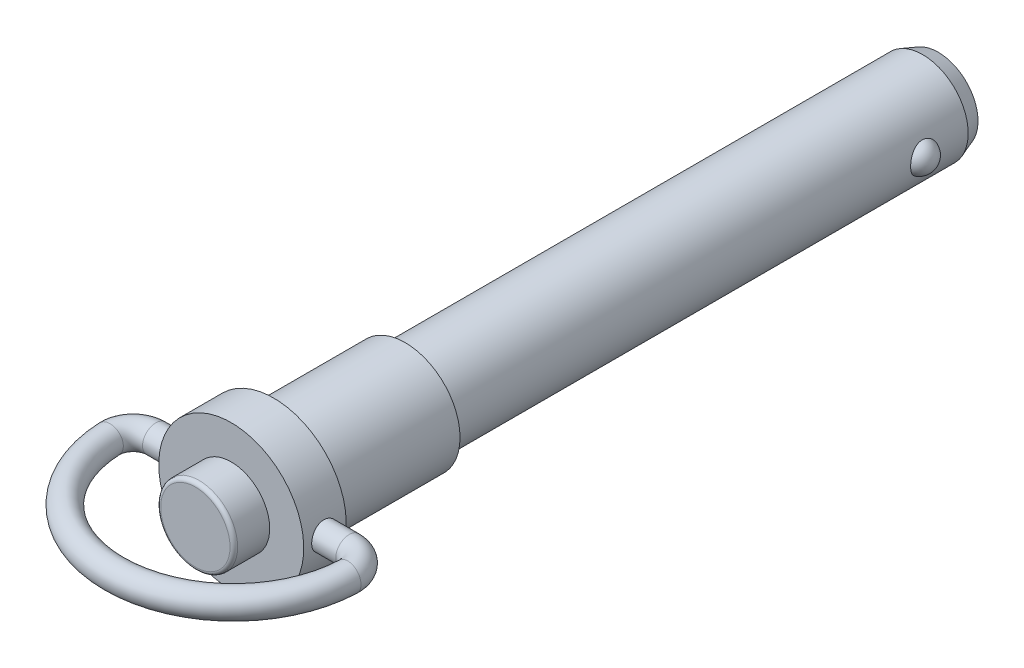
ISO-10303-21;
HEADER;
FILE_DESCRIPTION(('STEP AP214'),'2;1');
FILE_NAME('part.step','',(''),(''),'','','');
FILE_SCHEMA(('AUTOMOTIVE_DESIGN { 1 0 10303 214 1 1 1 1 }'));
ENDSEC;
DATA;
#1=APPLICATION_CONTEXT('core data for automotive mechanical design processes');
#2=APPLICATION_PROTOCOL_DEFINITION('international standard','automotive_design',2000,#1);
#3=PRODUCT_CONTEXT('',#1,'mechanical');
#4=PRODUCT('Part','Part','',(#3));
#5=PRODUCT_RELATED_PRODUCT_CATEGORY('part','',(#4));
#6=PRODUCT_DEFINITION_FORMATION('','',#4);
#7=PRODUCT_DEFINITION_CONTEXT('part definition',#1,'design');
#8=PRODUCT_DEFINITION('design','',#6,#7);
#9=PRODUCT_DEFINITION_SHAPE('','',#8);
#10=(LENGTH_UNIT() NAMED_UNIT(*) SI_UNIT(.MILLI.,.METRE.));
#11=(NAMED_UNIT(*) PLANE_ANGLE_UNIT() SI_UNIT($,.RADIAN.));
#12=(NAMED_UNIT(*) SI_UNIT($,.STERADIAN.) SOLID_ANGLE_UNIT());
#13=UNCERTAINTY_MEASURE_WITH_UNIT(LENGTH_MEASURE(1.E-05),#10,'distance_accuracy_value','');
#14=(GEOMETRIC_REPRESENTATION_CONTEXT(3) GLOBAL_UNCERTAINTY_ASSIGNED_CONTEXT((#13)) GLOBAL_UNIT_ASSIGNED_CONTEXT((#10,
#11,#12)) REPRESENTATION_CONTEXT('',''));
#15=CARTESIAN_POINT('',(0.,0.,0.));
#16=DIRECTION('',(0.,0.,1.));
#17=DIRECTION('',(1.,0.,0.));
#18=AXIS2_PLACEMENT_3D('',#15,#16,#17);
#19=CARTESIAN_POINT('',(-5.23004748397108,0.,-70.0304));
#20=DIRECTION('',(0.,0.,1.));
#21=DIRECTION('',(0.,1.,0.));
#22=AXIS2_PLACEMENT_3D('',#19,#20,#21);
#23=PLANE('',#22);
#24=CARTESIAN_POINT('',(0.,0.,-70.0303999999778));
#25=DIRECTION('',(0.,0.,1.));
#26=DIRECTION('',(0.,1.,0.));
#27=AXIS2_PLACEMENT_3D('',#24,#25,#26);
#28=CIRCLE('',#27,5.23004748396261);
#29=CARTESIAN_POINT('',(0.,5.23004748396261,-70.0303999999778));
#30=VERTEX_POINT('',#29);
#31=EDGE_CURVE('E117',#30,#30,#28,.T.);
#32=ORIENTED_EDGE('',*,*,#31,.F.);
#33=EDGE_LOOP('',(#32));
#34=FACE_BOUND('',#33,.T.);
#35=ADVANCED_FACE('F12',(#34),#23,.F.);
#36=CARTESIAN_POINT('',(-5.24129,0.,-62.2834));
#37=DIRECTION('',(0.,0.,1.));
#38=DIRECTION('',(-1.,0.,0.));
#39=AXIS2_PLACEMENT_3D('',#36,#37,#38);
#40=SPHERICAL_SURFACE('',#39,1.98374);
#41=CARTESIAN_POINT('',(-5.969635,0.,-60.4382067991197));
#42=CARTESIAN_POINT('',(-5.96963006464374,-0.11101568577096,-60.4382116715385));
#43=CARTESIAN_POINT('',(-5.96650644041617,-0.222143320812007,-60.4470278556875));
#44=CARTESIAN_POINT('',(-5.95431160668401,-0.441381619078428,-60.4821762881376));
#45=CARTESIAN_POINT('',(-5.9452309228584,-0.549487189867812,-60.5085364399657));
#46=CARTESIAN_POINT('',(-5.92206953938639,-0.759461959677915,-60.5783068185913));
#47=CARTESIAN_POINT('',(-5.90799052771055,-0.861333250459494,-60.6217112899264));
#48=CARTESIAN_POINT('',(-5.87633956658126,-1.05588670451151,-60.7247452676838));
#49=CARTESIAN_POINT('',(-5.85876868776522,-1.14857167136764,-60.7843698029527));
#50=CARTESIAN_POINT('',(-5.82223010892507,-1.32133430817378,-60.9181231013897));
#51=CARTESIAN_POINT('',(-5.80327429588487,-1.40150415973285,-60.9921358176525));
#52=CARTESIAN_POINT('',(-5.76604946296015,-1.54754922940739,-61.1533071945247));
#53=CARTESIAN_POINT('',(-5.74778035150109,-1.61342635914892,-61.2404640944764));
#54=CARTESIAN_POINT('',(-5.71483308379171,-1.72643370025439,-61.4221868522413));
#55=CARTESIAN_POINT('',(-5.70004608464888,-1.77417349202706,-61.5163531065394));
#56=CARTESIAN_POINT('',(-5.67505831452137,-1.8525561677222,-61.7121159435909));
#57=CARTESIAN_POINT('',(-5.66485545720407,-1.88320683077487,-61.8137091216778));
#58=CARTESIAN_POINT('',(-5.65080765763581,-1.92493419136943,-62.0148687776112));
#59=CARTESIAN_POINT('',(-5.64661793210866,-1.93707510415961,-62.1141910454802));
#60=CARTESIAN_POINT('',(-5.64397531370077,-1.94476367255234,-62.3135411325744));
#61=CARTESIAN_POINT('',(-5.64552102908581,-1.94031535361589,-62.4135687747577));
#62=CARTESIAN_POINT('',(-5.65399944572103,-1.9154603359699,-62.6076677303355));
#63=CARTESIAN_POINT('',(-5.66073469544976,-1.89563839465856,-62.7018234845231));
#64=CARTESIAN_POINT('',(-5.67860059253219,-1.84142507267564,-62.8853806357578));
#65=CARTESIAN_POINT('',(-5.68973152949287,-1.80703273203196,-62.9747817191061));
#66=CARTESIAN_POINT('',(-5.71546454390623,-1.72392617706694,-63.1482988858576));
#67=CARTESIAN_POINT('',(-5.730129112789,-1.67494987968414,-63.2322806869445));
#68=CARTESIAN_POINT('',(-5.75347973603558,-1.59211635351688,-63.3513225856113));
#69=CARTESIAN_POINT('',(-5.7614912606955,-1.56293448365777,-63.38985758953));
#70=CARTESIAN_POINT('',(-5.7777780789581,-1.50160973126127,-63.464489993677));
#71=CARTESIAN_POINT('',(-5.78605358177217,-1.46946445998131,-63.5005853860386));
#72=CARTESIAN_POINT('',(-5.81187985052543,-1.36524181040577,-63.6087062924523));
#73=CARTESIAN_POINT('',(-5.82954302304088,-1.2884006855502,-63.6762048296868));
#74=CARTESIAN_POINT('',(-5.86333936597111,-1.12462015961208,-63.7980676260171));
#75=CARTESIAN_POINT('',(-5.87947206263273,-1.0376776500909,-63.8524278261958));
#76=CARTESIAN_POINT('',(-5.90173079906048,-0.899149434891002,-63.9246002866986));
#77=CARTESIAN_POINT('',(-5.9089754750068,-0.85033751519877,-63.9475231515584));
#78=CARTESIAN_POINT('',(-5.92242841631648,-0.750927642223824,-63.9893690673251));
#79=CARTESIAN_POINT('',(-5.92863755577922,-0.700331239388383,-64.0082954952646));
#80=CARTESIAN_POINT('',(-5.93985979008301,-0.597720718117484,-64.0420647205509));
#81=CARTESIAN_POINT('',(-5.9448739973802,-0.545707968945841,-64.0569113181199));
#82=CARTESIAN_POINT('',(-5.95358843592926,-0.440577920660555,-64.08248082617));
#83=CARTESIAN_POINT('',(-5.95728882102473,-0.387460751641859,-64.093204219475));
#84=CARTESIAN_POINT('',(-5.96337469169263,-0.278836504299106,-64.11074630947));
#85=CARTESIAN_POINT('',(-5.96571659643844,-0.223305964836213,-64.1174358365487));
#86=CARTESIAN_POINT('',(-5.96884799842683,-0.111859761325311,-64.1263605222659));
#87=CARTESIAN_POINT('',(-5.96963748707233,-0.0559440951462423,-64.1285956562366));
#88=CARTESIAN_POINT('',(-5.96963006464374,0.111015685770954,-64.1285883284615));
#89=CARTESIAN_POINT('',(-5.96650644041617,0.222143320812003,-64.1197721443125));
#90=CARTESIAN_POINT('',(-5.95431160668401,0.441381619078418,-64.0846237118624));
#91=CARTESIAN_POINT('',(-5.94523092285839,0.549487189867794,-64.0582635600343));
#92=CARTESIAN_POINT('',(-5.92206953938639,0.759461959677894,-63.9884931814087));
#93=CARTESIAN_POINT('',(-5.90799052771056,0.861333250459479,-63.9450887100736));
#94=CARTESIAN_POINT('',(-5.87633956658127,1.05588670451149,-63.8420547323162));
#95=CARTESIAN_POINT('',(-5.85876868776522,1.1485716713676,-63.7824301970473));
#96=CARTESIAN_POINT('',(-5.82223010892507,1.32133430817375,-63.6486768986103));
#97=CARTESIAN_POINT('',(-5.80327429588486,1.40150415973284,-63.5746641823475));
#98=CARTESIAN_POINT('',(-5.76604946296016,1.54754922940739,-63.4134928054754));
#99=CARTESIAN_POINT('',(-5.7477803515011,1.61342635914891,-63.3263359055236));
#100=CARTESIAN_POINT('',(-5.71483308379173,1.72643370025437,-63.1446131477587));
#101=CARTESIAN_POINT('',(-5.70004608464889,1.77417349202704,-63.0504468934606));
#102=CARTESIAN_POINT('',(-5.67505831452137,1.85255616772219,-62.8546840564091));
#103=CARTESIAN_POINT('',(-5.66485545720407,1.88320683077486,-62.7530908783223));
#104=CARTESIAN_POINT('',(-5.65080765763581,1.92493419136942,-62.5519312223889));
#105=CARTESIAN_POINT('',(-5.64661793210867,1.9370751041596,-62.4526089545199));
#106=CARTESIAN_POINT('',(-5.64397531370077,1.94476367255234,-62.2532588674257));
#107=CARTESIAN_POINT('',(-5.64552102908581,1.94031535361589,-62.1532312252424));
#108=CARTESIAN_POINT('',(-5.65399944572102,1.91546033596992,-61.9591322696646));
#109=CARTESIAN_POINT('',(-5.66073469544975,1.89563839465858,-61.864976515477));
#110=CARTESIAN_POINT('',(-5.67860059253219,1.84142507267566,-61.6814193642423));
#111=CARTESIAN_POINT('',(-5.68973152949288,1.80703273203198,-61.592018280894));
#112=CARTESIAN_POINT('',(-5.71546454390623,1.72392617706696,-61.4185011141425));
#113=CARTESIAN_POINT('',(-5.73012911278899,1.67494987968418,-61.3345193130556));
#114=CARTESIAN_POINT('',(-5.75347973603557,1.59211635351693,-61.2154774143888));
#115=CARTESIAN_POINT('',(-5.76149126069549,1.56293448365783,-61.17694241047));
#116=CARTESIAN_POINT('',(-5.77777807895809,1.50160973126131,-61.1023100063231));
#117=CARTESIAN_POINT('',(-5.78605358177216,1.46946445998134,-61.0662146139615));
#118=CARTESIAN_POINT('',(-5.81187985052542,1.36524181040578,-60.9580937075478));
#119=CARTESIAN_POINT('',(-5.82954302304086,1.28840068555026,-60.8905951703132));
#120=CARTESIAN_POINT('',(-5.8633393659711,1.12462015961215,-60.7687323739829));
#121=CARTESIAN_POINT('',(-5.87947206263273,1.03767765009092,-60.7143721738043));
#122=CARTESIAN_POINT('',(-5.90173079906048,0.899149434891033,-60.6421997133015));
#123=CARTESIAN_POINT('',(-5.90897547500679,0.850337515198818,-60.6192768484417));
#124=CARTESIAN_POINT('',(-5.92242841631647,0.750927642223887,-60.577430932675));
#125=CARTESIAN_POINT('',(-5.92863755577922,0.700331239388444,-60.5585045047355));
#126=CARTESIAN_POINT('',(-5.939859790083,0.597720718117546,-60.5247352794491));
#127=CARTESIAN_POINT('',(-5.9448739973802,0.545707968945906,-60.5098886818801));
#128=CARTESIAN_POINT('',(-5.95358843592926,0.440577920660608,-60.48431917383));
#129=CARTESIAN_POINT('',(-5.95728882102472,0.387460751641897,-60.4735957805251));
#130=CARTESIAN_POINT('',(-5.96337469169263,0.278836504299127,-60.4560536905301));
#131=CARTESIAN_POINT('',(-5.96571659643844,0.223305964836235,-60.4493641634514));
#132=CARTESIAN_POINT('',(-5.96884799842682,0.111859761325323,-60.4404394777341));
#133=CARTESIAN_POINT('',(-5.96963748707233,0.0559440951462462,-60.4382043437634));
#134=CARTESIAN_POINT('',(-5.969635,0.,-60.4382067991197));
#135=B_SPLINE_CURVE_WITH_KNOTS('',3,(#41,#42,#43,#44,#45,#46,#47,#48,#49,#50,#51,#52,#53,#54,
#55,#56,#57,#58,#59,#60,#61,#62,#63,#64,#65,#66,#67,#68,#69,#70,#71,#72,#73,#74,#75,#76,#77,#78,
#79,#80,#81,#82,#83,#84,#85,#86,#87,#88,#89,#90,#91,#92,#93,#94,#95,#96,#97,#98,#99,#100,#101,
#102,#103,#104,#105,#106,#107,#108,#109,#110,#111,#112,#113,#114,#115,#116,#117,#118,#119,#120,
#121,#122,#123,#124,#125,#126,#127,#128,#129,#130,#131,#132,#133,#134),.UNSPECIFIED.,.T.,.F.,(4,
2,2,2,2,2,2,2,2,2,2,2,2,2,2,2,2,2,2,2,2,2,2,2,2,2,2,2,2,2,2,2,2,2,2,2,2,2,2,2,2,2,2,2,2,2,4),
(0.,0.332850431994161,0.666231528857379,0.999500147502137,1.33266674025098,1.66325004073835,
1.99378909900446,2.31195183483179,2.62996962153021,2.92890394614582,3.22776573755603,
3.51578606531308,3.80382537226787,4.09739019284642,4.24425224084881,4.39123372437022,
4.70115251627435,5.0111669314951,5.17424099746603,5.33717670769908,5.49996013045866,
5.66272448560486,5.83045675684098,5.9981899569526,6.33104038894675,6.66442148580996,
6.99769010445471,7.33085669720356,7.66143999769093,7.99197905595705,8.31014179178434,
8.62815957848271,8.92709390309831,9.22595569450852,9.51397602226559,9.80201532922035,
10.0955801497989,10.2424421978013,10.3894236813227,10.6993424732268,11.0093568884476,
11.1724309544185,11.3353666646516,11.4981500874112,11.6609144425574,11.8286467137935,
11.9963799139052),.UNSPECIFIED.);
#136=CARTESIAN_POINT('',(-5.969635,0.,-60.4382067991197));
#137=VERTEX_POINT('',#136);
#138=EDGE_CURVE('E30',#137,#137,#135,.T.);
#139=ORIENTED_EDGE('',*,*,#138,.F.);
#140=EDGE_LOOP('',(#139));
#141=FACE_BOUND('',#140,.T.);
#142=ADVANCED_FACE('F103',(#141),#40,.T.);
#143=CARTESIAN_POINT('',(5.24123,0.,-62.2834));
#144=DIRECTION('',(0.,0.,1.));
#145=DIRECTION('',(-1.,0.,0.));
#146=AXIS2_PLACEMENT_3D('',#143,#144,#145);
#147=SPHERICAL_SURFACE('',#146,1.98374);
#148=CARTESIAN_POINT('',(5.969635,0.,-64.1285695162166));
#149=CARTESIAN_POINT('',(5.96963006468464,-0.111015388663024,-64.1285646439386));
#150=CARTESIAN_POINT('',(5.96650645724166,-0.222142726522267,-64.1197484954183));
#151=CARTESIAN_POINT('',(5.95431168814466,-0.441380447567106,-64.0846001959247));
#152=CARTESIAN_POINT('',(5.94523105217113,-0.549485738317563,-64.0582401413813));
#153=CARTESIAN_POINT('',(5.92206978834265,-0.759459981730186,-63.9884699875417));
#154=CARTESIAN_POINT('',(5.90799084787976,-0.861331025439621,-63.945065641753));
#155=CARTESIAN_POINT('',(5.87634005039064,-1.05588398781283,-63.8420319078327));
#156=CARTESIAN_POINT('',(5.85876926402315,-1.14856871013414,-63.782407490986));
#157=CARTESIAN_POINT('',(5.82223094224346,-1.32133060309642,-63.6486545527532));
#158=CARTESIAN_POINT('',(5.80327529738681,-1.40149998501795,-63.5746421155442));
#159=CARTESIAN_POINT('',(5.76605083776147,-1.54754408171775,-63.4134712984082));
#160=CARTESIAN_POINT('',(5.74778193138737,-1.61342070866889,-63.3263146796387));
#161=CARTESIAN_POINT('',(5.71483520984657,-1.72642663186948,-63.144593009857));
#162=CARTESIAN_POINT('',(5.70004853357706,-1.77416560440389,-63.0504276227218));
#163=CARTESIAN_POINT('',(5.67506139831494,-1.85254670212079,-62.8546666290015));
#164=CARTESIAN_POINT('',(5.66485885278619,-1.88319660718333,-62.7530744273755));
#165=CARTESIAN_POINT('',(5.65081166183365,-1.92492242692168,-62.5519173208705));
#166=CARTESIAN_POINT('',(5.64662220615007,-1.9370626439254,-62.4525966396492));
#167=CARTESIAN_POINT('',(5.64398000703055,-1.94475005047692,-62.2532498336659));
#168=CARTESIAN_POINT('',(5.64552587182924,-1.94030126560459,-62.1532238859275));
#169=CARTESIAN_POINT('',(5.65400443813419,-1.91544560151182,-61.9591284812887));
#170=CARTESIAN_POINT('',(5.66073968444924,-1.89562349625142,-61.8649745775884));
#171=CARTESIAN_POINT('',(5.6786054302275,-1.84141015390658,-61.6814211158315));
#172=CARTESIAN_POINT('',(5.68973621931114,-1.80701795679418,-61.592021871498));
#173=CARTESIAN_POINT('',(5.71546883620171,-1.72391193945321,-61.418508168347));
#174=CARTESIAN_POINT('',(5.73013315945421,-1.67493601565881,-61.3345280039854));
#175=CARTESIAN_POINT('',(5.75348335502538,-1.5921032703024,-61.2154884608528));
#176=CARTESIAN_POINT('',(5.76149472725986,-1.56292169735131,-61.1769542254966));
#177=CARTESIAN_POINT('',(5.77778122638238,-1.50159761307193,-61.102323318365));
#178=CARTESIAN_POINT('',(5.78605656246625,-1.4694527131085,-61.0662286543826));
#179=CARTESIAN_POINT('',(5.81188236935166,-1.3652310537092,-60.9581096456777));
#180=CARTESIAN_POINT('',(5.82954523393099,-1.28839062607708,-60.8906122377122));
#181=CARTESIAN_POINT('',(5.86334097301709,-1.12461171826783,-60.7687514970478));
#182=CARTESIAN_POINT('',(5.87947337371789,-1.03767012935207,-60.7143922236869));
#183=CARTESIAN_POINT('',(5.90173174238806,-0.899143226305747,-60.6422208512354));
#184=CARTESIAN_POINT('',(5.90897632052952,-0.850331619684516,-60.6192982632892));
#185=CARTESIAN_POINT('',(5.92242907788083,-0.750922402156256,-60.5774528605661));
#186=CARTESIAN_POINT('',(5.92863813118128,-0.700326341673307,-60.5585266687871));
#187=CARTESIAN_POINT('',(5.93986020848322,-0.597716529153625,-60.5247578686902));
#188=CARTESIAN_POINT('',(5.94487434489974,-0.54570414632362,-60.5099114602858));
#189=CARTESIAN_POINT('',(5.95358865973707,-0.440574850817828,-60.4843422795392));
#190=CARTESIAN_POINT('',(5.95728899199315,-0.387458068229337,-60.4736190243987));
#191=CARTESIAN_POINT('',(5.96337477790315,-0.278834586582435,-60.4560771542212));
#192=CARTESIAN_POINT('',(5.96571665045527,-0.22330442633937,-60.4493877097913));
#193=CARTESIAN_POINT('',(5.96884800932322,-0.111858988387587,-60.4404631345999));
#194=CARTESIAN_POINT('',(5.96963748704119,-0.0559437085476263,-60.4382280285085));
#195=CARTESIAN_POINT('',(5.96963006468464,0.111015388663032,-60.4382353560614));
#196=CARTESIAN_POINT('',(5.96650645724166,0.222142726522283,-60.4470515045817));
#197=CARTESIAN_POINT('',(5.95431168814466,0.44138044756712,-60.4821998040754));
#198=CARTESIAN_POINT('',(5.94523105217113,0.549485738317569,-60.5085598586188));
#199=CARTESIAN_POINT('',(5.92206978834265,0.759459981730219,-60.5783300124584));
#200=CARTESIAN_POINT('',(5.90799084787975,0.86133102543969,-60.6217343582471));
#201=CARTESIAN_POINT('',(5.87634005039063,1.0558839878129,-60.7247680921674));
#202=CARTESIAN_POINT('',(5.85876926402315,1.14856871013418,-60.7843925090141));
#203=CARTESIAN_POINT('',(5.82223094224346,1.32133060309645,-60.9181454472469));
#204=CARTESIAN_POINT('',(5.8032752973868,1.40149998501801,-60.9921578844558));
#205=CARTESIAN_POINT('',(5.76605083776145,1.5475440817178,-61.1533287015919));
#206=CARTESIAN_POINT('',(5.74778193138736,1.61342070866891,-61.2404853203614));
#207=CARTESIAN_POINT('',(5.71483520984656,1.7264266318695,-61.4222069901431));
#208=CARTESIAN_POINT('',(5.70004853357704,1.77416560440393,-61.5163723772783));
#209=CARTESIAN_POINT('',(5.67506139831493,1.85254670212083,-61.7121333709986));
#210=CARTESIAN_POINT('',(5.66485885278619,1.88319660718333,-61.8137255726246));
#211=CARTESIAN_POINT('',(5.65081166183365,1.92492242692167,-62.0148826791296));
#212=CARTESIAN_POINT('',(5.64662220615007,1.93706264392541,-62.1142033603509));
#213=CARTESIAN_POINT('',(5.64398000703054,1.94475005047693,-62.3135501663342));
#214=CARTESIAN_POINT('',(5.64552587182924,1.94030126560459,-62.4135761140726));
#215=CARTESIAN_POINT('',(5.65400443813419,1.9154456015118,-62.6076715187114));
#216=CARTESIAN_POINT('',(5.66073968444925,1.8956234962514,-62.7018254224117));
#217=CARTESIAN_POINT('',(5.67860543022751,1.84141015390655,-62.8853788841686));
#218=CARTESIAN_POINT('',(5.68973621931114,1.80701795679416,-62.9747781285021));
#219=CARTESIAN_POINT('',(5.71546883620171,1.72391193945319,-63.1482918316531));
#220=CARTESIAN_POINT('',(5.73013315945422,1.67493601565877,-63.2322719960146));
#221=CARTESIAN_POINT('',(5.75348335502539,1.59210327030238,-63.3513115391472));
#222=CARTESIAN_POINT('',(5.76149472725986,1.56292169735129,-63.3898457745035));
#223=CARTESIAN_POINT('',(5.77778122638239,1.50159761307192,-63.4644766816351));
#224=CARTESIAN_POINT('',(5.78605656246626,1.46945271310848,-63.5005713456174));
#225=CARTESIAN_POINT('',(5.81188236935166,1.36523105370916,-63.6086903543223));
#226=CARTESIAN_POINT('',(5.82954523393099,1.28839062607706,-63.6761877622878));
#227=CARTESIAN_POINT('',(5.8633409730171,1.12461171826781,-63.7980485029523));
#228=CARTESIAN_POINT('',(5.8794733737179,1.03767012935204,-63.8524077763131));
#229=CARTESIAN_POINT('',(5.90173174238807,0.89914322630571,-63.9245791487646));
#230=CARTESIAN_POINT('',(5.90897632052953,0.85033161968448,-63.9475017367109));
#231=CARTESIAN_POINT('',(5.92242907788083,0.750922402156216,-63.9893471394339));
#232=CARTESIAN_POINT('',(5.92863813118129,0.700326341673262,-64.0082733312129));
#233=CARTESIAN_POINT('',(5.93986020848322,0.59771652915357,-64.0420421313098));
#234=CARTESIAN_POINT('',(5.94487434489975,0.54570414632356,-64.0568885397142));
#235=CARTESIAN_POINT('',(5.95358865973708,0.440574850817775,-64.0824577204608));
#236=CARTESIAN_POINT('',(5.95728899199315,0.387458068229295,-64.0931809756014));
#237=CARTESIAN_POINT('',(5.96337477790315,0.278834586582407,-64.1107228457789));
#238=CARTESIAN_POINT('',(5.96571665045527,0.223304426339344,-64.1174122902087));
#239=CARTESIAN_POINT('',(5.96884800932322,0.111858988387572,-64.1263368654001));
#240=CARTESIAN_POINT('',(5.96963748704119,0.0559437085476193,-64.1285719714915));
#241=CARTESIAN_POINT('',(5.969635,0.,-64.1285695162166));
#242=B_SPLINE_CURVE_WITH_KNOTS('',3,(#148,#149,#150,#151,#152,#153,#154,#155,#156,#157,#158,
#159,#160,#161,#162,#163,#164,#165,#166,#167,#168,#169,#170,#171,#172,#173,#174,#175,#176,#177,
#178,#179,#180,#181,#182,#183,#184,#185,#186,#187,#188,#189,#190,#191,#192,#193,#194,#195,#196,
#197,#198,#199,#200,#201,#202,#203,#204,#205,#206,#207,#208,#209,#210,#211,#212,#213,#214,#215,
#216,#217,#218,#219,#220,#221,#222,#223,#224,#225,#226,#227,#228,#229,#230,#231,#232,#233,#234,
#235,#236,#237,#238,#239,#240,#241),.UNSPECIFIED.,.T.,.F.,(4,2,2,2,2,2,2,2,2,2,2,2,2,2,2,2,2,2,
2,2,2,2,2,2,2,2,2,2,2,2,2,2,2,2,2,2,2,2,2,2,2,2,2,2,2,2,4),(0.,0.332849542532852,
0.666229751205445,0.999497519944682,1.33266326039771,1.66324488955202,1.99378226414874,
2.3119414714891,2.6299557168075,2.92888505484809,3.22774185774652,3.51575689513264,
3.80379091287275,4.0973509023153,4.24421053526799,4.39118959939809,4.70110451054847,
5.01111505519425,5.1741878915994,5.33712237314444,5.49990457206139,5.66266770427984,
5.83039881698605,5.99813085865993,6.33098040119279,6.66436060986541,6.99762837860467,
7.3307941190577,7.66137574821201,7.99191312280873,8.3100723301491,8.6280865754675,
8.92701591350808,9.2258727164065,9.51388775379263,9.80192177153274,10.0954817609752,
10.2423413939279,10.389320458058,10.6992353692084,11.0092459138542,11.1723187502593,
11.3352532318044,11.4980354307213,11.6607985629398,11.828529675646,11.9962617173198),.UNSPECIFIED.);
#243=CARTESIAN_POINT('',(5.969635,0.,-64.1285695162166));
#244=VERTEX_POINT('',#243);
#245=EDGE_CURVE('E8',#244,#244,#242,.T.);
#246=ORIENTED_EDGE('',*,*,#245,.F.);
#247=EDGE_LOOP('',(#246));
#248=FACE_BOUND('',#247,.T.);
#249=ADVANCED_FACE('F44',(#248),#147,.T.);
#250=CARTESIAN_POINT('',(0.,0.,-67.9984000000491));
#251=DIRECTION('',(0.,0.,1.));
#252=DIRECTION('',(0.,1.,0.));
#253=AXIS2_PLACEMENT_3D('',#250,#251,#252);
#254=CONICAL_SURFACE('',#253,5.96963499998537,0.349065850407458);
#255=ORIENTED_EDGE('',*,*,#31,.T.);
#256=EDGE_LOOP('',(#255));
#257=FACE_BOUND('',#256,.T.);
#258=CARTESIAN_POINT('',(0.,0.,-67.9984));
#259=DIRECTION('',(0.,0.,1.));
#260=DIRECTION('',(0.,1.,0.));
#261=AXIS2_PLACEMENT_3D('',#258,#259,#260);
#262=CIRCLE('',#261,5.969635);
#263=CARTESIAN_POINT('',(0.,5.969635,-67.9984));
#264=VERTEX_POINT('',#263);
#265=EDGE_CURVE('E25',#264,#264,#262,.T.);
#266=ORIENTED_EDGE('',*,*,#265,.F.);
#267=EDGE_LOOP('',(#266));
#268=FACE_BOUND('',#267,.T.);
#269=ADVANCED_FACE('F54',(#257,#268),#254,.T.);
#270=CARTESIAN_POINT('',(0.,0.,-30.));
#271=DIRECTION('',(0.,0.,1.));
#272=DIRECTION('',(0.810321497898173,0.585985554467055,0.));
#273=AXIS2_PLACEMENT_3D('',#270,#271,#272);
#274=CYLINDRICAL_SURFACE('',#273,5.969635);
#275=CARTESIAN_POINT('',(0.,0.,0.));
#276=DIRECTION('',(0.,0.,-1.));
#277=DIRECTION('',(0.,1.,0.));
#278=AXIS2_PLACEMENT_3D('',#275,#276,#277);
#279=CIRCLE('',#278,5.969635);
#280=CARTESIAN_POINT('',(0.,5.969635,0.));
#281=VERTEX_POINT('',#280);
#282=EDGE_CURVE('E71',#281,#281,#279,.T.);
#283=ORIENTED_EDGE('',*,*,#282,.T.);
#284=EDGE_LOOP('',(#283));
#285=FACE_BOUND('',#284,.T.);
#286=ORIENTED_EDGE('',*,*,#265,.T.);
#287=EDGE_LOOP('',(#286));
#288=FACE_BOUND('',#287,.T.);
#289=ORIENTED_EDGE('',*,*,#245,.T.);
#290=EDGE_LOOP('',(#289));
#291=FACE_BOUND('',#290,.T.);
#292=ORIENTED_EDGE('',*,*,#138,.T.);
#293=EDGE_LOOP('',(#292));
#294=FACE_BOUND('',#293,.T.);
#295=ADVANCED_FACE('F49',(#285,#288,#291,#294),#274,.T.);
#296=CARTESIAN_POINT('',(0.,0.,27.575));
#297=DIRECTION('',(0.,0.,1.));
#298=DIRECTION('',(1.,0.,0.));
#299=AXIS2_PLACEMENT_3D('',#296,#297,#298);
#300=PLANE('',#299);
#301=CARTESIAN_POINT('',(0.,0.,27.575));
#302=DIRECTION('',(0.,0.,1.));
#303=DIRECTION('',(1.,0.,0.));
#304=AXIS2_PLACEMENT_3D('',#301,#302,#303);
#305=CIRCLE('',#304,4.5546);
#306=CARTESIAN_POINT('',(4.5546,0.,27.575));
#307=VERTEX_POINT('',#306);
#308=EDGE_CURVE('E135',#307,#307,#305,.T.);
#309=ORIENTED_EDGE('',*,*,#308,.T.);
#310=EDGE_LOOP('',(#309));
#311=FACE_BOUND('',#310,.T.);
#312=ADVANCED_FACE('F53',(#311),#300,.T.);
#313=CARTESIAN_POINT('',(0.,0.,22.5357550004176));
#314=DIRECTION('',(0.,1.,0.));
#315=DIRECTION('',(0.,0.,1.));
#316=AXIS2_PLACEMENT_3D('',#313,#314,#315);
#317=TOROIDAL_SURFACE('',#316,15.6980038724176,1.75);
#318=CARTESIAN_POINT('',(-15.6851704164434,0.,23.1703844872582));
#319=DIRECTION('',(-0.0404274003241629,0.,-0.999182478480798));
#320=DIRECTION('',(-0.999182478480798,0.,0.0404274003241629));
#321=AXIS2_PLACEMENT_3D('',#318,#319,#320);
#322=CIRCLE('',#321,1.75);
#323=CARTESIAN_POINT('',(-17.4337397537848,0.,23.2411324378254));
#324=VERTEX_POINT('',#323);
#325=EDGE_CURVE('E126',#324,#324,#322,.T.);
#326=CARTESIAN_POINT('',(15.6851704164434,0.,23.1703844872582));
#327=DIRECTION('',(-0.0404274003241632,0.,0.999182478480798));
#328=DIRECTION('',(0.999182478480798,0.,0.0404274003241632));
#329=AXIS2_PLACEMENT_3D('',#326,#327,#328);
#330=CIRCLE('',#329,1.75);
#331=CARTESIAN_POINT('',(17.4337397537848,0.,23.2411324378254));
#332=VERTEX_POINT('',#331);
#333=EDGE_CURVE('E129',#332,#332,#330,.T.);
#334=CARTESIAN_POINT('',(0.,0.,22.5357550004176));
#335=DIRECTION('',(0.,1.,0.));
#336=DIRECTION('',(0.,0.,1.));
#337=AXIS2_PLACEMENT_3D('',#334,#335,#336);
#338=CIRCLE('',#337,17.4480038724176);
#339=EDGE_CURVE('',#324,#332,#338,.T.);
#340=ORIENTED_EDGE('',*,*,#325,.F.);
#341=ORIENTED_EDGE('',*,*,#333,.T.);
#342=ORIENTED_EDGE('',*,*,#339,.T.);
#343=ORIENTED_EDGE('',*,*,#339,.F.);
#344=EDGE_LOOP('',(#340,#342,#341,#343));
#345=FACE_BOUND('',#344,.T.);
#346=ADVANCED_FACE('F167',(#345),#317,.T.);
#347=CARTESIAN_POINT('',(0.,0.,27.075));
#348=DIRECTION('',(0.,0.,1.));
#349=DIRECTION('',(1.,0.,0.));
#350=AXIS2_PLACEMENT_3D('',#347,#348,#349);
#351=TOROIDAL_SURFACE('',#350,4.5546,0.5);
#352=CARTESIAN_POINT('',(0.,0.,27.075));
#353=DIRECTION('',(0.,0.,1.));
#354=DIRECTION('',(1.,0.,0.));
#355=AXIS2_PLACEMENT_3D('',#352,#353,#354);
#356=CIRCLE('',#355,5.0546);
#357=CARTESIAN_POINT('',(5.0546,0.,27.075));
#358=VERTEX_POINT('',#357);
#359=EDGE_CURVE('E138',#358,#358,#356,.T.);
#360=ORIENTED_EDGE('',*,*,#359,.T.);
#361=EDGE_LOOP('',(#360));
#362=FACE_BOUND('',#361,.T.);
#363=ORIENTED_EDGE('',*,*,#308,.F.);
#364=EDGE_LOOP('',(#363));
#365=FACE_BOUND('',#364,.T.);
#366=ADVANCED_FACE('F94',(#362,#365),#351,.T.);
#367=CARTESIAN_POINT('',(12.7038508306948,0.,23.0497588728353));
#368=DIRECTION('',(0.,1.,0.));
#369=DIRECTION('',(0.,0.,1.));
#370=AXIS2_PLACEMENT_3D('',#367,#368,#369);
#371=TOROIDAL_SURFACE('',#370,2.98375887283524,1.75);
#372=CARTESIAN_POINT('',(12.7038508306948,0.,20.066));
#373=DIRECTION('',(1.,0.,0.));
#374=DIRECTION('',(0.,0.,-1.));
#375=AXIS2_PLACEMENT_3D('',#372,#373,#374);
#376=CIRCLE('',#375,1.75);
#377=CARTESIAN_POINT('',(12.7038508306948,0.,18.316));
#378=VERTEX_POINT('',#377);
#379=EDGE_CURVE('E132',#378,#378,#376,.T.);
#380=CARTESIAN_POINT('',(12.7038508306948,0.,23.0497588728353));
#381=DIRECTION('',(0.,1.,0.));
#382=DIRECTION('',(0.,0.,1.));
#383=AXIS2_PLACEMENT_3D('',#380,#381,#382);
#384=CIRCLE('',#383,4.73375887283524);
#385=EDGE_CURVE('',#332,#378,#384,.T.);
#386=ORIENTED_EDGE('',*,*,#333,.F.);
#387=ORIENTED_EDGE('',*,*,#379,.T.);
#388=ORIENTED_EDGE('',*,*,#385,.T.);
#389=ORIENTED_EDGE('',*,*,#385,.F.);
#390=EDGE_LOOP('',(#386,#388,#387,#389));
#391=FACE_BOUND('',#390,.T.);
#392=ADVANCED_FACE('F165',(#391),#371,.T.);
#393=CARTESIAN_POINT('',(-12.7038508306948,0.,23.0497588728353));
#394=DIRECTION('',(0.,1.,0.));
#395=DIRECTION('',(0.,0.,1.));
#396=AXIS2_PLACEMENT_3D('',#393,#394,#395);
#397=TOROIDAL_SURFACE('',#396,2.98375887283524,1.75);
#398=CARTESIAN_POINT('',(-12.7038508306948,0.,20.066));
#399=DIRECTION('',(1.,0.,0.));
#400=DIRECTION('',(0.,0.,-1.));
#401=AXIS2_PLACEMENT_3D('',#398,#399,#400);
#402=CIRCLE('',#401,1.75);
#403=CARTESIAN_POINT('',(-12.7038508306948,0.,18.316));
#404=VERTEX_POINT('',#403);
#405=EDGE_CURVE('E123',#404,#404,#402,.T.);
#406=CARTESIAN_POINT('',(-12.7038508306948,0.,23.0497588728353));
#407=DIRECTION('',(0.,1.,0.));
#408=DIRECTION('',(0.,0.,1.));
#409=AXIS2_PLACEMENT_3D('',#406,#407,#408);
#410=CIRCLE('',#409,4.73375887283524);
#411=EDGE_CURVE('',#404,#324,#410,.T.);
#412=ORIENTED_EDGE('',*,*,#405,.F.);
#413=ORIENTED_EDGE('',*,*,#325,.T.);
#414=ORIENTED_EDGE('',*,*,#411,.T.);
#415=ORIENTED_EDGE('',*,*,#411,.F.);
#416=EDGE_LOOP('',(#412,#414,#413,#415));
#417=FACE_BOUND('',#416,.T.);
#418=ADVANCED_FACE('F63',(#417),#397,.T.);
#419=CARTESIAN_POINT('',(0.,0.,28.575));
#420=DIRECTION('',(0.,0.,-1.));
#421=DIRECTION('',(0.,-1.,0.));
#422=AXIS2_PLACEMENT_3D('',#419,#420,#421);
#423=CYLINDRICAL_SURFACE('',#422,5.0546);
#424=ORIENTED_EDGE('',*,*,#359,.F.);
#425=EDGE_LOOP('',(#424));
#426=FACE_BOUND('',#425,.T.);
#427=CARTESIAN_POINT('',(0.,0.,22.86));
#428=DIRECTION('',(0.,0.,-1.));
#429=DIRECTION('',(0.,-1.,0.));
#430=AXIS2_PLACEMENT_3D('',#427,#428,#429);
#431=CIRCLE('',#430,5.0546);
#432=CARTESIAN_POINT('',(0.,-5.0546,22.86));
#433=VERTEX_POINT('',#432);
#434=EDGE_CURVE('E73',#433,#433,#431,.T.);
#435=ORIENTED_EDGE('',*,*,#434,.F.);
#436=EDGE_LOOP('',(#435));
#437=FACE_BOUND('',#436,.T.);
#438=ADVANCED_FACE('F81',(#426,#437),#423,.T.);
#439=CARTESIAN_POINT('',(12.7038508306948,0.,20.066));
#440=DIRECTION('',(-1.,0.,0.));
#441=DIRECTION('',(0.,0.,1.));
#442=AXIS2_PLACEMENT_3D('',#439,#440,#441);
#443=CYLINDRICAL_SURFACE('',#442,1.75);
#444=CARTESIAN_POINT('',(9.525,0.,21.816));
#445=CARTESIAN_POINT('',(9.52499824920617,0.0974196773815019,21.8159962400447));
#446=CARTESIAN_POINT('',(9.52348996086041,0.194888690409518,21.8078377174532));
#447=CARTESIAN_POINT('',(9.51761845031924,0.387082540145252,21.7754387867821));
#448=CARTESIAN_POINT('',(9.5132527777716,0.481804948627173,21.7511845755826));
#449=CARTESIAN_POINT('',(9.50215510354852,0.66569803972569,21.6873599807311));
#450=CARTESIAN_POINT('',(9.49542520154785,0.75487356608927,21.6478031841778));
#451=CARTESIAN_POINT('',(9.48033492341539,0.925313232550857,21.5545343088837));
#452=CARTESIAN_POINT('',(9.4719746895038,1.00657806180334,21.5008234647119));
#453=CARTESIAN_POINT('',(9.45443959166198,1.15983447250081,21.38011409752));
#454=CARTESIAN_POINT('',(9.44525721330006,1.23172173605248,21.3129842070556));
#455=CARTESIAN_POINT('',(9.42716883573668,1.36328019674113,21.1676249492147));
#456=CARTESIAN_POINT('',(9.41826285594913,1.42295053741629,21.0893948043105));
#457=CARTESIAN_POINT('',(9.40166266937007,1.52881224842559,20.9233223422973));
#458=CARTESIAN_POINT('',(9.39397815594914,1.57489805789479,20.8354116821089));
#459=CARTESIAN_POINT('',(9.3807965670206,1.65160688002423,20.6529311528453));
#460=CARTESIAN_POINT('',(9.3752993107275,1.68223117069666,20.5583618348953));
#461=CARTESIAN_POINT('',(9.36719014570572,1.72681399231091,20.3663627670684));
#462=CARTESIAN_POINT('',(9.36454682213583,1.74095411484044,20.2689765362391));
#463=CARTESIAN_POINT('',(9.36235004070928,1.75273074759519,20.0731807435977));
#464=CARTESIAN_POINT('',(9.3627963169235,1.75036867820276,19.9747712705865));
#465=CARTESIAN_POINT('',(9.36669969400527,1.72935535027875,19.7810343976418));
#466=CARTESIAN_POINT('',(9.37011871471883,1.71091010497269,19.6856837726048));
#467=CARTESIAN_POINT('',(9.37952256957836,1.65857824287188,19.49945389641));
#468=CARTESIAN_POINT('',(9.38550750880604,1.62469099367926,19.4085748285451));
#469=CARTESIAN_POINT('',(9.39940890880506,1.54223419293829,19.2332623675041));
#470=CARTESIAN_POINT('',(9.40733632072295,1.49358101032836,19.1488692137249));
#471=CARTESIAN_POINT('',(9.42422213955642,1.38303261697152,18.98936699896));
#472=CARTESIAN_POINT('',(9.43318064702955,1.32113611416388,18.9142588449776));
#473=CARTESIAN_POINT('',(9.45128545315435,1.184745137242,18.77426795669));
#474=CARTESIAN_POINT('',(9.46043254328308,1.11007434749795,18.7095569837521));
#475=CARTESIAN_POINT('',(9.47775926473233,0.950845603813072,18.5935547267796));
#476=CARTESIAN_POINT('',(9.48593888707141,0.866287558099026,18.5422635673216));
#477=CARTESIAN_POINT('',(9.50042458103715,0.689508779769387,18.4545334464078));
#478=CARTESIAN_POINT('',(9.50672846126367,0.597279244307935,18.4181118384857));
#479=CARTESIAN_POINT('',(9.51673535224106,0.407869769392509,18.3613256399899));
#480=CARTESIAN_POINT('',(9.52043862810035,0.310690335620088,18.3409594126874));
#481=CARTESIAN_POINT('',(9.5247907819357,0.115617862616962,18.3170999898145));
#482=CARTESIAN_POINT('',(9.52548227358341,0.0177545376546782,18.313371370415));
#483=CARTESIAN_POINT('',(9.52385046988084,-0.17719740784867,18.3222622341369));
#484=CARTESIAN_POINT('',(9.52152731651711,-0.274286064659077,18.3348809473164));
#485=CARTESIAN_POINT('',(9.51415375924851,-0.46418965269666,18.3759125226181));
#486=CARTESIAN_POINT('',(9.50912384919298,-0.557031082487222,18.4042067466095));
#487=CARTESIAN_POINT('',(9.49689842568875,-0.736652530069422,18.4756581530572));
#488=CARTESIAN_POINT('',(9.48970276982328,-0.823432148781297,18.5188163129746));
#489=CARTESIAN_POINT('',(9.47383776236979,-0.98947475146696,18.6192949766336));
#490=CARTESIAN_POINT('',(9.46515367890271,-1.06864888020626,18.676759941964));
#491=CARTESIAN_POINT('',(9.44731421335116,-1.21631462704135,18.8040249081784));
#492=CARTESIAN_POINT('',(9.43815878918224,-1.28480528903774,18.873826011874));
#493=CARTESIAN_POINT('',(9.42026781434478,-1.41005035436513,19.0248458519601));
#494=CARTESIAN_POINT('',(9.41153908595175,-1.46664438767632,19.1061985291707));
#495=CARTESIAN_POINT('',(9.39562517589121,-1.56536359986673,19.277394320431));
#496=CARTESIAN_POINT('',(9.38843993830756,-1.60748930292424,19.3672371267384));
#497=CARTESIAN_POINT('',(9.3764796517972,-1.67584630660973,19.5524479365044));
#498=CARTESIAN_POINT('',(9.37169329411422,-1.70215230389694,19.6477876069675));
#499=CARTESIAN_POINT('',(9.36504636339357,-1.73835449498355,19.8416293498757));
#500=CARTESIAN_POINT('',(9.36318547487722,-1.7482524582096,19.9401310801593));
#501=CARTESIAN_POINT('',(9.3626157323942,-1.75130025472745,20.1358954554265));
#502=CARTESIAN_POINT('',(9.36385929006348,-1.74470294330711,20.2331541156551));
#503=CARTESIAN_POINT('',(9.36925303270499,-1.71549975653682,20.4251511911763));
#504=CARTESIAN_POINT('',(9.37340320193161,-1.69289396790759,20.5198896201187));
#505=CARTESIAN_POINT('',(9.38412287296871,-1.63242039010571,20.7040281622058));
#506=CARTESIAN_POINT('',(9.39068820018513,-1.5945789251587,20.7934371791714));
#507=CARTESIAN_POINT('',(9.40550157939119,-1.50473547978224,20.964677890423));
#508=CARTESIAN_POINT('',(9.41374974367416,-1.45273255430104,21.0465090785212));
#509=CARTESIAN_POINT('',(9.43114776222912,-1.33515884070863,21.2015399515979));
#510=CARTESIAN_POINT('',(9.44030888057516,-1.26940363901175,21.2745985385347));
#511=CARTESIAN_POINT('',(9.45841527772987,-1.12657740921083,21.4087295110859));
#512=CARTESIAN_POINT('',(9.4673605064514,-1.04950378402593,21.4697991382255));
#513=CARTESIAN_POINT('',(9.4841172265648,-0.885436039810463,21.5787070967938));
#514=CARTESIAN_POINT('',(9.49191831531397,-0.798362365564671,21.6264272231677));
#515=CARTESIAN_POINT('',(9.50540634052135,-0.617319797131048,21.7064857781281));
#516=CARTESIAN_POINT('',(9.51109528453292,-0.523357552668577,21.7388388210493));
#517=CARTESIAN_POINT('',(9.51854259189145,-0.357584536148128,21.7805891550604));
#518=CARTESIAN_POINT('',(9.52095058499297,-0.286749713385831,21.7938458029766));
#519=CARTESIAN_POINT('',(9.52417991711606,-0.143952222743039,21.8115525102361));
#520=CARTESIAN_POINT('',(9.52500129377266,-0.0719895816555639,21.8160027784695));
#521=CARTESIAN_POINT('',(9.525,0.,21.816));
#522=B_SPLINE_CURVE_WITH_KNOTS('',3,(#444,#445,#446,#447,#448,#449,#450,#451,#452,#453,#454,
#455,#456,#457,#458,#459,#460,#461,#462,#463,#464,#465,#466,#467,#468,#469,#470,#471,#472,#473,
#474,#475,#476,#477,#478,#479,#480,#481,#482,#483,#484,#485,#486,#487,#488,#489,#490,#491,#492,
#493,#494,#495,#496,#497,#498,#499,#500,#501,#502,#503,#504,#505,#506,#507,#508,#509,#510,#511,
#512,#513,#514,#515,#516,#517,#518,#519,#520,#521),.UNSPECIFIED.,.T.,.F.,(4,2,2,2,2,2,2,2,2,2,2,
2,2,2,2,2,2,2,2,2,2,2,2,2,2,2,2,2,2,2,2,2,2,2,2,2,2,2,4),(0.,0.291995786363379,
0.584242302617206,0.876229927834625,1.16819209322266,1.46316632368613,1.75816122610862,
2.05539140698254,2.35259701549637,2.64649667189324,2.94037103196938,3.23053548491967,
3.52071182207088,3.81256333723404,4.10444333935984,4.40073615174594,4.69703171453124,
4.9936720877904,5.29028221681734,5.58268169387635,5.87506739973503,6.1652698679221,
6.45549142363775,6.74877158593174,7.04207797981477,7.3391152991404,7.63614185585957,
7.93175468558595,8.22733563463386,8.51841349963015,8.80948978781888,9.10006529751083,
9.39066020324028,9.68543533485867,9.98027821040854,10.2776546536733,10.574747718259,
10.7905270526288,11.0063012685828),.UNSPECIFIED.);
#523=CARTESIAN_POINT('',(9.525,0.,21.816));
#524=VERTEX_POINT('',#523);
#525=EDGE_CURVE('E16',#524,#524,#522,.T.);
#526=ORIENTED_EDGE('',*,*,#525,.F.);
#527=EDGE_LOOP('',(#526));
#528=FACE_BOUND('',#527,.T.);
#529=ORIENTED_EDGE('',*,*,#379,.F.);
#530=EDGE_LOOP('',(#529));
#531=FACE_BOUND('',#530,.T.);
#532=ADVANCED_FACE('F61',(#528,#531),#443,.T.);
#533=CARTESIAN_POINT('',(-12.7038508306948,0.,20.066));
#534=DIRECTION('',(1.,0.,0.));
#535=DIRECTION('',(0.,0.,-1.));
#536=AXIS2_PLACEMENT_3D('',#533,#534,#535);
#537=CYLINDRICAL_SURFACE('',#536,1.75);
#538=CARTESIAN_POINT('',(-9.525,0.,18.316));
#539=CARTESIAN_POINT('',(-9.52499824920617,-0.097419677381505,18.3160037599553));
#540=CARTESIAN_POINT('',(-9.52348996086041,-0.194888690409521,18.3241622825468));
#541=CARTESIAN_POINT('',(-9.51761845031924,-0.387082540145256,18.3565612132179));
#542=CARTESIAN_POINT('',(-9.5132527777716,-0.481804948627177,18.3808154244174));
#543=CARTESIAN_POINT('',(-9.50215510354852,-0.665698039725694,18.4446400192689));
#544=CARTESIAN_POINT('',(-9.49542520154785,-0.754873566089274,18.4841968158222));
#545=CARTESIAN_POINT('',(-9.48033492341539,-0.925313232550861,18.5774656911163));
#546=CARTESIAN_POINT('',(-9.4719746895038,-1.00657806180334,18.6311765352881));
#547=CARTESIAN_POINT('',(-9.45443959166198,-1.15983447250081,18.75188590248));
#548=CARTESIAN_POINT('',(-9.44525721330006,-1.23172173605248,18.8190157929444));
#549=CARTESIAN_POINT('',(-9.42716883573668,-1.36328019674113,18.9643750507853));
#550=CARTESIAN_POINT('',(-9.41826285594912,-1.4229505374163,19.0426051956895));
#551=CARTESIAN_POINT('',(-9.40166266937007,-1.52881224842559,19.2086776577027));
#552=CARTESIAN_POINT('',(-9.39397815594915,-1.57489805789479,19.2965883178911));
#553=CARTESIAN_POINT('',(-9.3807965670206,-1.65160688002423,19.4790688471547));
#554=CARTESIAN_POINT('',(-9.3752993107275,-1.68223117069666,19.5736381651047));
#555=CARTESIAN_POINT('',(-9.36719014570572,-1.72681399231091,19.7656372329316));
#556=CARTESIAN_POINT('',(-9.36454682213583,-1.74095411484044,19.8630234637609));
#557=CARTESIAN_POINT('',(-9.36235004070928,-1.7527307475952,20.0588192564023));
#558=CARTESIAN_POINT('',(-9.3627963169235,-1.75036867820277,20.1572287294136));
#559=CARTESIAN_POINT('',(-9.36669969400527,-1.72935535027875,20.3509656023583));
#560=CARTESIAN_POINT('',(-9.37011871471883,-1.71091010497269,20.4463162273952));
#561=CARTESIAN_POINT('',(-9.37952256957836,-1.65857824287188,20.63254610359));
#562=CARTESIAN_POINT('',(-9.38550750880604,-1.62469099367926,20.7234251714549));
#563=CARTESIAN_POINT('',(-9.39940890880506,-1.54223419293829,20.8987376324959));
#564=CARTESIAN_POINT('',(-9.40733632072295,-1.49358101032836,20.9831307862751));
#565=CARTESIAN_POINT('',(-9.42422213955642,-1.38303261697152,21.14263300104));
#566=CARTESIAN_POINT('',(-9.43318064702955,-1.32113611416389,21.2177411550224));
#567=CARTESIAN_POINT('',(-9.45128545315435,-1.184745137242,21.35773204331));
#568=CARTESIAN_POINT('',(-9.46043254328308,-1.11007434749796,21.4224430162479));
#569=CARTESIAN_POINT('',(-9.47775926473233,-0.950845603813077,21.5384452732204));
#570=CARTESIAN_POINT('',(-9.48593888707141,-0.86628755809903,21.5897364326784));
#571=CARTESIAN_POINT('',(-9.50042458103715,-0.689508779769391,21.6774665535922));
#572=CARTESIAN_POINT('',(-9.50672846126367,-0.597279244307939,21.7138881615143));
#573=CARTESIAN_POINT('',(-9.51673535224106,-0.407869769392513,21.7706743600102));
#574=CARTESIAN_POINT('',(-9.52043862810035,-0.310690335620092,21.7910405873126));
#575=CARTESIAN_POINT('',(-9.5247907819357,-0.115617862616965,21.8149000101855));
#576=CARTESIAN_POINT('',(-9.52548227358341,-0.0177545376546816,21.818628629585));
#577=CARTESIAN_POINT('',(-9.52385046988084,0.177197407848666,21.8097377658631));
#578=CARTESIAN_POINT('',(-9.52152731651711,0.274286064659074,21.7971190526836));
#579=CARTESIAN_POINT('',(-9.51415375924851,0.464189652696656,21.7560874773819));
#580=CARTESIAN_POINT('',(-9.50912384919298,0.557031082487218,21.7277932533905));
#581=CARTESIAN_POINT('',(-9.49689842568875,0.736652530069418,21.6563418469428));
#582=CARTESIAN_POINT('',(-9.48970276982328,0.823432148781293,21.6131836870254));
#583=CARTESIAN_POINT('',(-9.47383776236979,0.989474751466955,21.5127050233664));
#584=CARTESIAN_POINT('',(-9.46515367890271,1.06864888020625,21.455240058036));
#585=CARTESIAN_POINT('',(-9.44731421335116,1.21631462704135,21.3279750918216));
#586=CARTESIAN_POINT('',(-9.43815878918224,1.28480528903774,21.258173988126));
#587=CARTESIAN_POINT('',(-9.42026781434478,1.41005035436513,21.1071541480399));
#588=CARTESIAN_POINT('',(-9.41153908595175,1.46664438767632,21.0258014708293));
#589=CARTESIAN_POINT('',(-9.39562517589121,1.56536359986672,20.854605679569));
#590=CARTESIAN_POINT('',(-9.38843993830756,1.60748930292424,20.7647628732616));
#591=CARTESIAN_POINT('',(-9.3764796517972,1.67584630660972,20.5795520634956));
#592=CARTESIAN_POINT('',(-9.37169329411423,1.70215230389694,20.4842123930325));
#593=CARTESIAN_POINT('',(-9.36504636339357,1.73835449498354,20.2903706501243));
#594=CARTESIAN_POINT('',(-9.36318547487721,1.74825245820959,20.1918689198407));
#595=CARTESIAN_POINT('',(-9.3626157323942,1.75130025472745,19.9961045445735));
#596=CARTESIAN_POINT('',(-9.36385929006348,1.74470294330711,19.8988458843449));
#597=CARTESIAN_POINT('',(-9.36925303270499,1.71549975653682,19.7068488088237));
#598=CARTESIAN_POINT('',(-9.3734032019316,1.69289396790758,19.6121103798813));
#599=CARTESIAN_POINT('',(-9.3841228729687,1.6324203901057,19.4279718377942));
#600=CARTESIAN_POINT('',(-9.39068820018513,1.5945789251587,19.3385628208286));
#601=CARTESIAN_POINT('',(-9.40550157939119,1.50473547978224,19.167322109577));
#602=CARTESIAN_POINT('',(-9.41374974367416,1.45273255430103,19.0854909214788));
#603=CARTESIAN_POINT('',(-9.43114776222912,1.33515884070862,18.9304600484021));
#604=CARTESIAN_POINT('',(-9.44030888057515,1.26940363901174,18.8574014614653));
#605=CARTESIAN_POINT('',(-9.45841527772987,1.12657740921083,18.7232704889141));
#606=CARTESIAN_POINT('',(-9.4673605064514,1.04950378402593,18.6622008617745));
#607=CARTESIAN_POINT('',(-9.4841172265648,0.885436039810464,18.5532929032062));
#608=CARTESIAN_POINT('',(-9.49191831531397,0.798362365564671,18.5055727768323));
#609=CARTESIAN_POINT('',(-9.50540634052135,0.617319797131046,18.4255142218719));
#610=CARTESIAN_POINT('',(-9.51109528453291,0.523357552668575,18.3931611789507));
#611=CARTESIAN_POINT('',(-9.51854259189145,0.357584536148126,18.3514108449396));
#612=CARTESIAN_POINT('',(-9.52095058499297,0.286749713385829,18.3381541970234));
#613=CARTESIAN_POINT('',(-9.52417991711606,0.143952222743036,18.3204474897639));
#614=CARTESIAN_POINT('',(-9.52500129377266,0.0719895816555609,18.3159972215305));
#615=CARTESIAN_POINT('',(-9.525,0.,18.316));
#616=B_SPLINE_CURVE_WITH_KNOTS('',3,(#538,#539,#540,#541,#542,#543,#544,#545,#546,#547,#548,
#549,#550,#551,#552,#553,#554,#555,#556,#557,#558,#559,#560,#561,#562,#563,#564,#565,#566,#567,
#568,#569,#570,#571,#572,#573,#574,#575,#576,#577,#578,#579,#580,#581,#582,#583,#584,#585,#586,
#587,#588,#589,#590,#591,#592,#593,#594,#595,#596,#597,#598,#599,#600,#601,#602,#603,#604,#605,
#606,#607,#608,#609,#610,#611,#612,#613,#614,#615),.UNSPECIFIED.,.T.,.F.,(4,2,2,2,2,2,2,2,2,2,2,
2,2,2,2,2,2,2,2,2,2,2,2,2,2,2,2,2,2,2,2,2,2,2,2,2,2,2,4),(0.,0.291995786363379,
0.584242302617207,0.876229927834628,1.16819209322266,1.46316632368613,1.75816122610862,
2.05539140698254,2.35259701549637,2.64649667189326,2.94037103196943,3.23053548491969,
3.52071182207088,3.81256333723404,4.10444333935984,4.40073615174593,4.69703171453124,
4.9936720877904,5.29028221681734,5.58268169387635,5.87506739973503,6.1652698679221,
6.45549142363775,6.74877158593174,7.04207797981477,7.3391152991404,7.63614185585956,
7.93175468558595,8.22733563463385,8.51841349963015,8.80948978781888,9.10006529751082,
9.39066020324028,9.68543533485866,9.98027821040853,10.2776546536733,10.574747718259,
10.7905270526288,11.0063012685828),.UNSPECIFIED.);
#617=CARTESIAN_POINT('',(-9.525,0.,18.316));
#618=VERTEX_POINT('',#617);
#619=EDGE_CURVE('E65',#618,#618,#616,.T.);
#620=ORIENTED_EDGE('',*,*,#619,.T.);
#621=EDGE_LOOP('',(#620));
#622=FACE_BOUND('',#621,.T.);
#623=ORIENTED_EDGE('',*,*,#405,.T.);
#624=EDGE_LOOP('',(#623));
#625=FACE_BOUND('',#624,.T.);
#626=ADVANCED_FACE('F56',(#622,#625),#537,.T.);
#627=CARTESIAN_POINT('',(-9.525,0.,22.86));
#628=DIRECTION('',(0.,0.,1.));
#629=DIRECTION('',(0.,1.,0.));
#630=AXIS2_PLACEMENT_3D('',#627,#628,#629);
#631=PLANE('',#630);
#632=ORIENTED_EDGE('',*,*,#434,.T.);
#633=EDGE_LOOP('',(#632));
#634=FACE_BOUND('',#633,.T.);
#635=CARTESIAN_POINT('',(0.,0.,22.86));
#636=DIRECTION('',(0.,0.,-1.));
#637=DIRECTION('',(0.,-1.,0.));
#638=AXIS2_PLACEMENT_3D('',#635,#636,#637);
#639=CIRCLE('',#638,9.525);
#640=CARTESIAN_POINT('',(0.,-9.525,22.86));
#641=VERTEX_POINT('',#640);
#642=EDGE_CURVE('E150',#641,#641,#639,.T.);
#643=ORIENTED_EDGE('',*,*,#642,.F.);
#644=EDGE_LOOP('',(#643));
#645=FACE_BOUND('',#644,.T.);
#646=ADVANCED_FACE('F60',(#634,#645),#631,.T.);
#647=CARTESIAN_POINT('',(0.,0.,0.));
#648=DIRECTION('',(0.,0.,-1.));
#649=DIRECTION('',(0.,-1.,0.));
#650=AXIS2_PLACEMENT_3D('',#647,#648,#649);
#651=CYLINDRICAL_SURFACE('',#650,9.525);
#652=CARTESIAN_POINT('',(0.,0.,17.272));
#653=DIRECTION('',(0.,0.,-1.));
#654=DIRECTION('',(0.,-1.,0.));
#655=AXIS2_PLACEMENT_3D('',#652,#653,#654);
#656=CIRCLE('',#655,9.525);
#657=CARTESIAN_POINT('',(0.,-9.525,17.272));
#658=VERTEX_POINT('',#657);
#659=EDGE_CURVE('E72',#658,#658,#656,.T.);
#660=ORIENTED_EDGE('',*,*,#659,.F.);
#661=EDGE_LOOP('',(#660));
#662=FACE_BOUND('',#661,.T.);
#663=ORIENTED_EDGE('',*,*,#642,.T.);
#664=EDGE_LOOP('',(#663));
#665=FACE_BOUND('',#664,.T.);
#666=ORIENTED_EDGE('',*,*,#619,.F.);
#667=EDGE_LOOP('',(#666));
#668=FACE_BOUND('',#667,.T.);
#669=ORIENTED_EDGE('',*,*,#525,.T.);
#670=EDGE_LOOP('',(#669));
#671=FACE_BOUND('',#670,.T.);
#672=ADVANCED_FACE('F75',(#662,#665,#668,#671),#651,.T.);
#673=CARTESIAN_POINT('',(-8.9535,0.,17.272));
#674=DIRECTION('',(0.,0.,-1.));
#675=DIRECTION('',(0.,-1.,0.));
#676=AXIS2_PLACEMENT_3D('',#673,#674,#675);
#677=PLANE('',#676);
#678=ORIENTED_EDGE('',*,*,#659,.T.);
#679=EDGE_LOOP('',(#678));
#680=FACE_BOUND('',#679,.T.);
#681=CARTESIAN_POINT('',(0.,0.,17.272));
#682=DIRECTION('',(0.,0.,1.));
#683=DIRECTION('',(1.,0.,0.));
#684=AXIS2_PLACEMENT_3D('',#681,#682,#683);
#685=CIRCLE('',#684,7.6);
#686=CARTESIAN_POINT('',(7.6,0.,17.272));
#687=VERTEX_POINT('',#686);
#688=EDGE_CURVE('E141',#687,#687,#685,.T.);
#689=ORIENTED_EDGE('',*,*,#688,.T.);
#690=EDGE_LOOP('',(#689));
#691=FACE_BOUND('',#690,.T.);
#692=ADVANCED_FACE('F79',(#680,#691),#677,.T.);
#693=CARTESIAN_POINT('',(0.,0.,16.872));
#694=DIRECTION('',(0.,0.,1.));
#695=DIRECTION('',(1.,0.,0.));
#696=AXIS2_PLACEMENT_3D('',#693,#694,#695);
#697=TOROIDAL_SURFACE('',#696,7.6,0.4);
#698=CARTESIAN_POINT('',(0.,0.,16.872));
#699=DIRECTION('',(0.,0.,1.));
#700=DIRECTION('',(1.,0.,0.));
#701=AXIS2_PLACEMENT_3D('',#698,#699,#700);
#702=CIRCLE('',#701,7.2);
#703=CARTESIAN_POINT('',(7.2,0.,16.872));
#704=VERTEX_POINT('',#703);
#705=EDGE_CURVE('E144',#704,#704,#702,.T.);
#706=ORIENTED_EDGE('',*,*,#705,.T.);
#707=EDGE_LOOP('',(#706));
#708=FACE_BOUND('',#707,.T.);
#709=ORIENTED_EDGE('',*,*,#688,.F.);
#710=EDGE_LOOP('',(#709));
#711=FACE_BOUND('',#710,.T.);
#712=ADVANCED_FACE('F85',(#708,#711),#697,.F.);
#713=CARTESIAN_POINT('',(0.,0.,30.025216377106));
#714=DIRECTION('',(0.,0.,1.));
#715=DIRECTION('',(1.,0.,0.));
#716=AXIS2_PLACEMENT_3D('',#713,#714,#715);
#717=CYLINDRICAL_SURFACE('',#716,7.2);
#718=CARTESIAN_POINT('',(0.,0.,0.));
#719=DIRECTION('',(0.,0.,1.));
#720=DIRECTION('',(1.,0.,0.));
#721=AXIS2_PLACEMENT_3D('',#718,#719,#720);
#722=CIRCLE('',#721,7.2);
#723=CARTESIAN_POINT('',(7.2,0.,0.));
#724=VERTEX_POINT('',#723);
#725=EDGE_CURVE('E147',#724,#724,#722,.T.);
#726=ORIENTED_EDGE('',*,*,#725,.T.);
#727=EDGE_LOOP('',(#726));
#728=FACE_BOUND('',#727,.T.);
#729=ORIENTED_EDGE('',*,*,#705,.F.);
#730=EDGE_LOOP('',(#729));
#731=FACE_BOUND('',#730,.T.);
#732=ADVANCED_FACE('F87',(#728,#731),#717,.T.);
#733=CARTESIAN_POINT('',(0.,0.,0.));
#734=DIRECTION('',(0.,0.,-1.));
#735=DIRECTION('',(0.,-1.,0.));
#736=AXIS2_PLACEMENT_3D('',#733,#734,#735);
#737=PLANE('',#736);
#738=ORIENTED_EDGE('',*,*,#725,.F.);
#739=EDGE_LOOP('',(#738));
#740=FACE_BOUND('',#739,.T.);
#741=ORIENTED_EDGE('',*,*,#282,.F.);
#742=EDGE_LOOP('',(#741));
#743=FACE_BOUND('',#742,.T.);
#744=ADVANCED_FACE('F14',(#740,#743),#737,.T.);
#745=CLOSED_SHELL('',(#35,#142,#249,#269,#295,#312,#346,#366,#392,#418,#438,#532,#626,#646,#672,
#692,#712,#732,#744));
#746=MANIFOLD_SOLID_BREP('B1',#745);
#747=ADVANCED_BREP_SHAPE_REPRESENTATION('',(#18,#746),#14);
#748=SHAPE_DEFINITION_REPRESENTATION(#9,#747);
ENDSEC;
END-ISO-10303-21;
